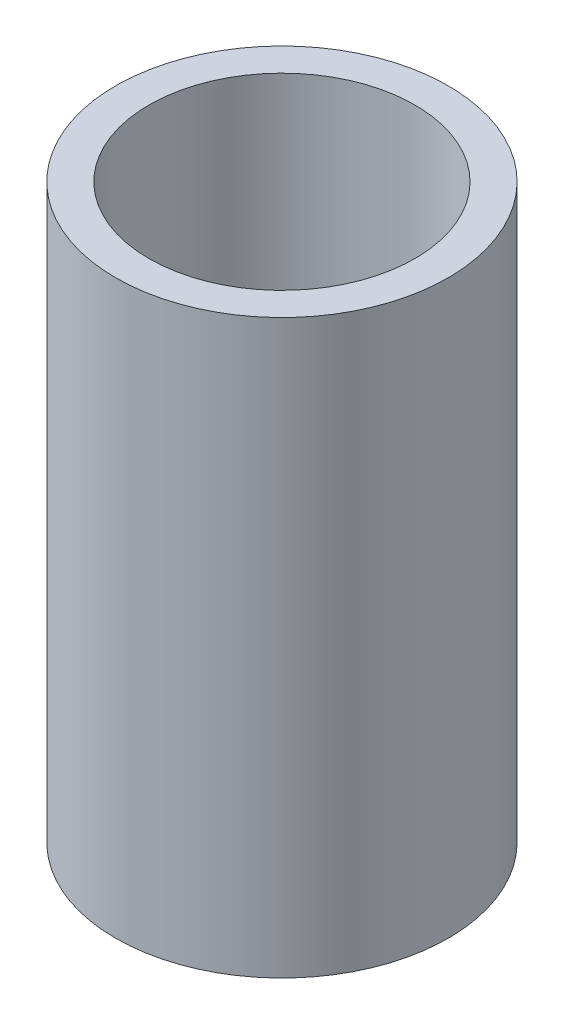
from build123d import *

# Parameters (mm, degrees)
ESQUISSE1_R      = 12.5
ESQUISSE1_R_2    = 10
EXTRUSION1_DEPTH = 43


with BuildPart() as part:
    # Esquisse1 → Extrusion1 (new body)
    with BuildSketch(Plane(origin=(0, 0, 0), x_dir=(1, 0, 0), z_dir=(0, 1, 0))):
        with Locations(Location((0, 0, 0), (0, 0, 270))):
            Circle(ESQUISSE1_R)
        with Locations(Location((0, 0, 0), (0, 0, 270))):
            Circle(ESQUISSE1_R_2, mode=Mode.SUBTRACT)
    extrude(amount=-EXTRUSION1_DEPTH)


solid = part.part
